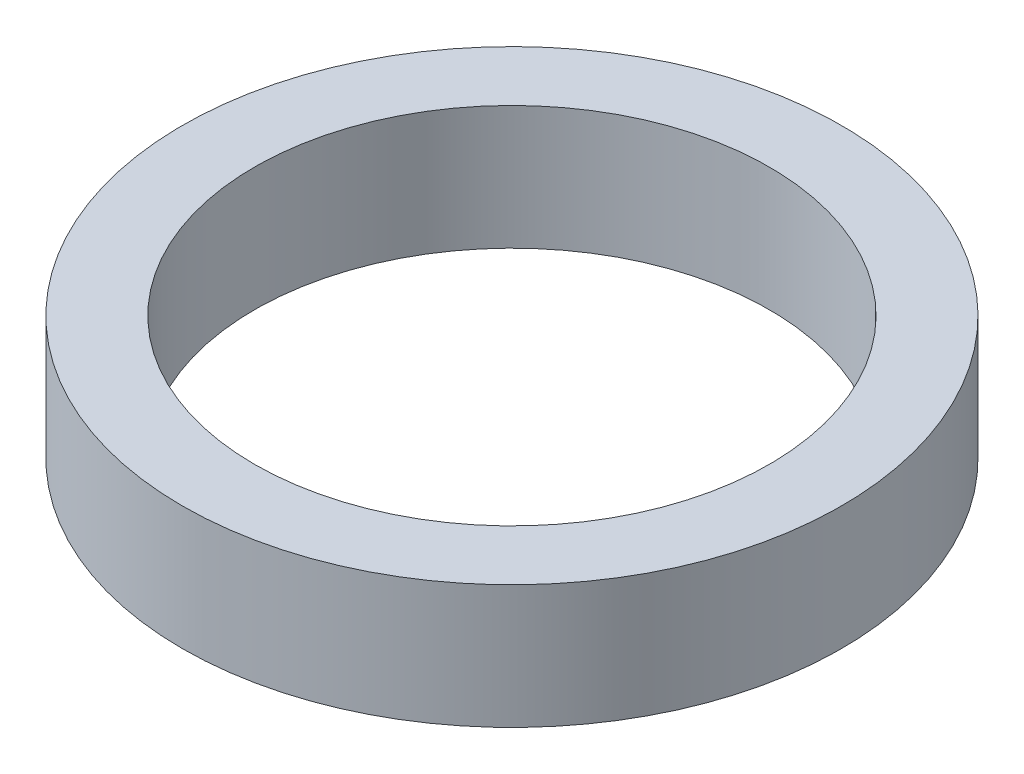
ISO-10303-21;
HEADER;
FILE_DESCRIPTION(('STEP AP214'),'2;1');
FILE_NAME('part.step','',(''),(''),'','','');
FILE_SCHEMA(('AUTOMOTIVE_DESIGN { 1 0 10303 214 1 1 1 1 }'));
ENDSEC;
DATA;
#1=APPLICATION_CONTEXT('core data for automotive mechanical design processes');
#2=APPLICATION_PROTOCOL_DEFINITION('international standard','automotive_design',2000,#1);
#3=PRODUCT_CONTEXT('',#1,'mechanical');
#4=PRODUCT('Part','Part','',(#3));
#5=PRODUCT_RELATED_PRODUCT_CATEGORY('part','',(#4));
#6=PRODUCT_DEFINITION_FORMATION('','',#4);
#7=PRODUCT_DEFINITION_CONTEXT('part definition',#1,'design');
#8=PRODUCT_DEFINITION('design','',#6,#7);
#9=PRODUCT_DEFINITION_SHAPE('','',#8);
#10=(LENGTH_UNIT() NAMED_UNIT(*) SI_UNIT(.MILLI.,.METRE.));
#11=(NAMED_UNIT(*) PLANE_ANGLE_UNIT() SI_UNIT($,.RADIAN.));
#12=(NAMED_UNIT(*) SI_UNIT($,.STERADIAN.) SOLID_ANGLE_UNIT());
#13=UNCERTAINTY_MEASURE_WITH_UNIT(LENGTH_MEASURE(1.E-05),#10,'distance_accuracy_value','');
#14=(GEOMETRIC_REPRESENTATION_CONTEXT(3) GLOBAL_UNCERTAINTY_ASSIGNED_CONTEXT((#13)) GLOBAL_UNIT_ASSIGNED_CONTEXT((#10,
#11,#12)) REPRESENTATION_CONTEXT('',''));
#15=CARTESIAN_POINT('',(0.,0.,0.));
#16=DIRECTION('',(0.,0.,1.));
#17=DIRECTION('',(1.,0.,0.));
#18=AXIS2_PLACEMENT_3D('',#15,#16,#17);
#19=CARTESIAN_POINT('',(0.,3.,0.));
#20=DIRECTION('',(0.,1.,0.));
#21=DIRECTION('',(0.,0.,1.));
#22=AXIS2_PLACEMENT_3D('',#19,#20,#21);
#23=PLANE('',#22);
#24=CARTESIAN_POINT('',(0.,3.,0.));
#25=DIRECTION('',(0.,1.,0.));
#26=DIRECTION('',(0.,0.,1.));
#27=AXIS2_PLACEMENT_3D('',#24,#25,#26);
#28=CIRCLE('',#27,8.);
#29=CARTESIAN_POINT('',(0.,3.,8.));
#30=VERTEX_POINT('',#29);
#31=EDGE_CURVE('E26',#30,#30,#28,.F.);
#32=ORIENTED_EDGE('',*,*,#31,.F.);
#33=EDGE_LOOP('',(#32));
#34=FACE_BOUND('',#33,.T.);
#35=CARTESIAN_POINT('',(0.,3.,0.));
#36=DIRECTION('',(0.,1.,0.));
#37=DIRECTION('',(0.,0.,1.));
#38=AXIS2_PLACEMENT_3D('',#35,#36,#37);
#39=CIRCLE('',#38,6.25);
#40=CARTESIAN_POINT('',(0.,3.,6.25));
#41=VERTEX_POINT('',#40);
#42=EDGE_CURVE('E17',#41,#41,#39,.F.);
#43=ORIENTED_EDGE('',*,*,#42,.T.);
#44=EDGE_LOOP('',(#43));
#45=FACE_BOUND('',#44,.T.);
#46=ADVANCED_FACE('F14',(#34,#45),#23,.T.);
#47=CARTESIAN_POINT('',(0.,0.,0.));
#48=DIRECTION('',(0.,1.,0.));
#49=DIRECTION('',(0.,0.,1.));
#50=AXIS2_PLACEMENT_3D('',#47,#48,#49);
#51=CYLINDRICAL_SURFACE('',#50,6.25);
#52=ORIENTED_EDGE('',*,*,#42,.F.);
#53=EDGE_LOOP('',(#52));
#54=FACE_BOUND('',#53,.T.);
#55=CARTESIAN_POINT('',(0.,0.,0.));
#56=DIRECTION('',(0.,1.,0.));
#57=DIRECTION('',(0.,0.,1.));
#58=AXIS2_PLACEMENT_3D('',#55,#56,#57);
#59=CIRCLE('',#58,6.25);
#60=CARTESIAN_POINT('',(0.,0.,6.25));
#61=VERTEX_POINT('',#60);
#62=EDGE_CURVE('E21',#61,#61,#59,.F.);
#63=ORIENTED_EDGE('',*,*,#62,.T.);
#64=EDGE_LOOP('',(#63));
#65=FACE_BOUND('',#64,.T.);
#66=ADVANCED_FACE('F35',(#54,#65),#51,.F.);
#67=CARTESIAN_POINT('',(0.,0.,0.));
#68=DIRECTION('',(0.,1.,0.));
#69=DIRECTION('',(0.,0.,1.));
#70=AXIS2_PLACEMENT_3D('',#67,#68,#69);
#71=CYLINDRICAL_SURFACE('',#70,8.);
#72=ORIENTED_EDGE('',*,*,#31,.T.);
#73=EDGE_LOOP('',(#72));
#74=FACE_BOUND('',#73,.T.);
#75=CARTESIAN_POINT('',(0.,0.,0.));
#76=DIRECTION('',(0.,1.,0.));
#77=DIRECTION('',(0.,0.,1.));
#78=AXIS2_PLACEMENT_3D('',#75,#76,#77);
#79=CIRCLE('',#78,8.);
#80=CARTESIAN_POINT('',(0.,0.,8.));
#81=VERTEX_POINT('',#80);
#82=EDGE_CURVE('E10',#81,#81,#79,.T.);
#83=ORIENTED_EDGE('',*,*,#82,.T.);
#84=EDGE_LOOP('',(#83));
#85=FACE_BOUND('',#84,.T.);
#86=ADVANCED_FACE('F38',(#74,#85),#71,.T.);
#87=CARTESIAN_POINT('',(0.,0.,0.));
#88=DIRECTION('',(0.,1.,0.));
#89=DIRECTION('',(0.,0.,1.));
#90=AXIS2_PLACEMENT_3D('',#87,#88,#89);
#91=PLANE('',#90);
#92=ORIENTED_EDGE('',*,*,#82,.F.);
#93=EDGE_LOOP('',(#92));
#94=FACE_BOUND('',#93,.T.);
#95=ORIENTED_EDGE('',*,*,#62,.F.);
#96=EDGE_LOOP('',(#95));
#97=FACE_BOUND('',#96,.T.);
#98=ADVANCED_FACE('F41',(#94,#97),#91,.F.);
#99=CLOSED_SHELL('',(#46,#66,#86,#98));
#100=MANIFOLD_SOLID_BREP('B1',#99);
#101=ADVANCED_BREP_SHAPE_REPRESENTATION('',(#18,#100),#14);
#102=SHAPE_DEFINITION_REPRESENTATION(#9,#101);
ENDSEC;
END-ISO-10303-21;
